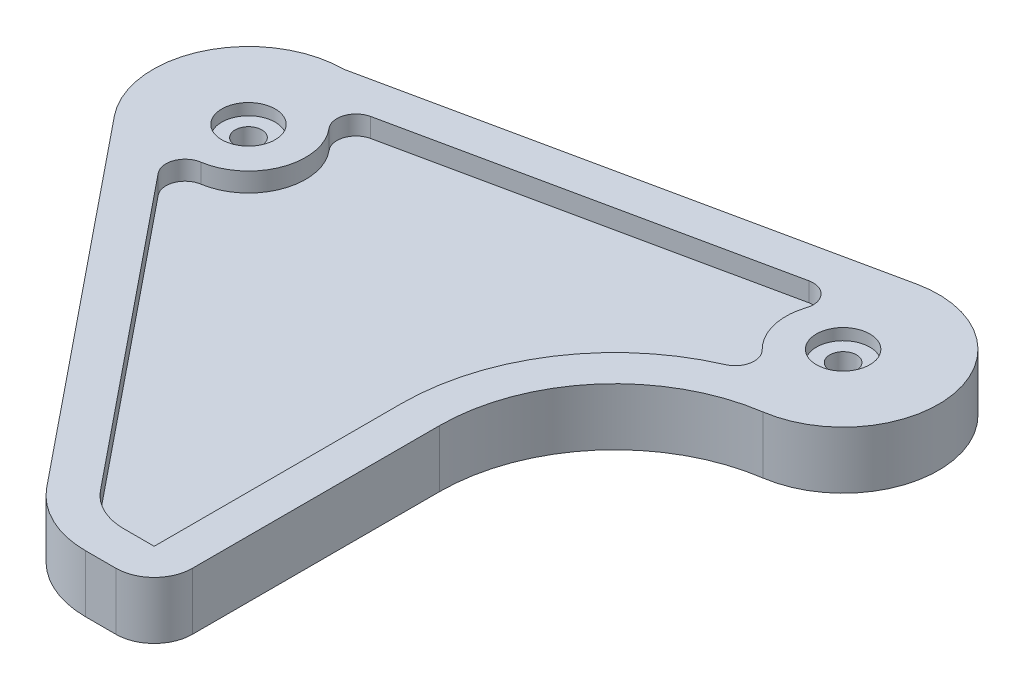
from build123d import *

# Parameters (mm, degrees)
EXTRUDE1_DEPTH           = 15
CUT_EXTRUDE1_DEPTH       = 5
C_BORE_HOLES_D           = 7.0000114
C_BORE_HOLES_CBORE_D     = 13.9999974
C_BORE_HOLES_CBORE_DEPTH = 2.999994


with BuildPart() as part:
    # Sketch1 → Extrude1 (new body)
    with BuildSketch(Plane(origin=(0, 0, 0), x_dir=(1, 0, 0), z_dir=(0, 1, 0))):
        with BuildLine():
            Line((0, 25), (123.80220773, 51.314971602))
            ThreePointArc((123.80220773, 51.314971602), (153.603301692, 31.297219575), (132.669805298, 2.132097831))
            ThreePointArc((132.669805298, 2.132097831), (104.58970249, -13.32473649), (93.422247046, -43.369600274))
            Line((93.422247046, -43.369600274), (93.422247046, -108.138718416))
            ThreePointArc((93.422247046, -108.138718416), (90.493314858, -115.209786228), (83.422247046, -118.138718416))
            Line((83.422247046, -118.138718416), (75.422247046, -118.138718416))
            ThreePointArc((75.422247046, -118.138718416), (64.659469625, -115.703350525), (55.993598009, -108.871728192))
            Line((55.993598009, -108.871728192), (-19.428649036, -15.733009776))
            ThreePointArc((-19.428649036, -15.733009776), (-22.564632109, 10.76277742), (0, 25))
        make_face()
    extrude(amount=EXTRUDE1_DEPTH)

    # Sketch3 → Cut-Extrude1 (cut)
    with BuildSketch(Plane(origin=(0, 15, 0), x_dir=(-1, 0, 0), z_dir=(0, 1, 0))):
        with BuildLine():
            ThreePointArc((-108.93931122, -37.932359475), (-113.694593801, -36.387274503), (-114.734152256, -31.496536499))
            ThreePointArc((-114.734152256, -31.496536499), (-114.436600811, -23.268594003), (-118.526682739, -16.123049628))
            ThreePointArc((-118.526682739, -16.123049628), (-119.954063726, -11.644479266), (-117.034484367, -7.960586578))
            ThreePointArc((-117.034484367, -7.960586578), (-92.572942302, 12.691552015), (-83.422247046, 43.369600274))
            Line((-83.422247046, 43.369600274), (-83.422247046, 108.138718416))
            Line((-83.422247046, 108.138718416), (-75.422247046, 108.138718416))
            ThreePointArc((-75.422247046, 108.138718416), (-68.964580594, 106.677497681), (-63.765057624, 102.578524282))
            Line((-63.765057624, 102.578524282), (0.757040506, 22.900368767))
            ThreePointArc((0.757040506, 22.900368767), (1.539212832, 17.961927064), (-2.346516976, 14.815325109))
            ThreePointArc((-2.346516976, 14.815325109), (-14.059626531, 5.227513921), (-11.455471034, -9.683603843))
            ThreePointArc((-11.455471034, -9.683603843), (-10.543411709, -14.530699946), (-14.234402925, -17.802209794))
            Line((-14.234402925, -17.802209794), (-108.93931122, -37.932359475))
        make_face()
    extrude(amount=-CUT_EXTRUDE1_DEPTH, mode=Mode.SUBTRACT)

    # C.Bore Holes (through all)
    with Locations(Plane(origin=(0, 15, 0), x_dir=(-1, 0, 0), z_dir=(0, 1, 0))):
        with Locations((0, 0), (-129, -26.861281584)):
            CounterBoreHole(C_BORE_HOLES_D / 2, C_BORE_HOLES_CBORE_D / 2, C_BORE_HOLES_CBORE_DEPTH)


solid = part.part
